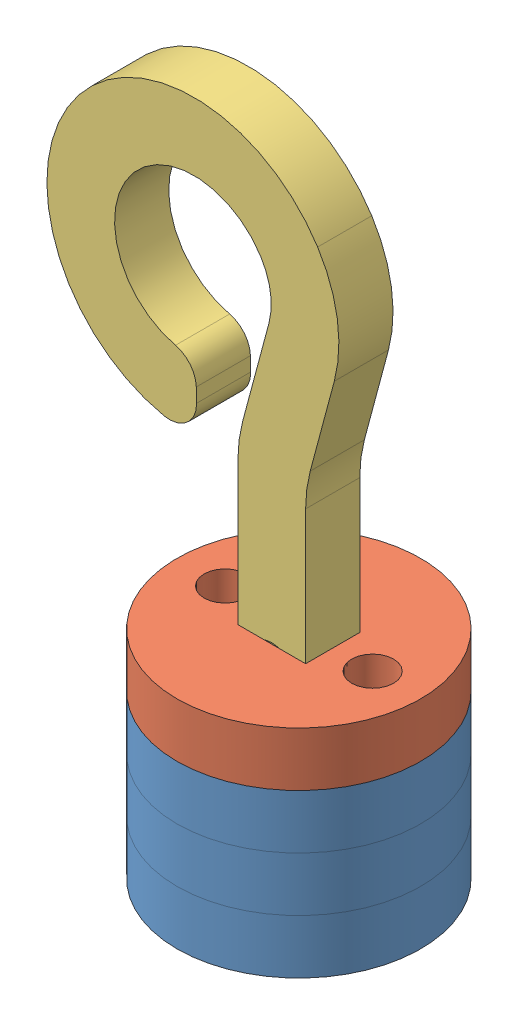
SolidWorks assembly LC_ASM.SLDASM, configuration Default (file format 10000). Lengths in mm.
Overall size (25.61 48.12 18).
5 component instances, 3 part files, 12 mates.
Components (placement in the parent):
- LC_MOTOR-1: LC_MOTOR.SLDPRT [Default] at (-77.2541 9.1015 35.9413) size (18 4 18)
- LC_CHOOK-1: LC_CHOOK.SLDPRT [LC_CHOOK] at (-77.2541 21.1015 35.9413) size (18 4 18)
- LC_MOTOR-2: LC_MOTOR.SLDPRT [Default] at (-77.2541 13.1015 35.9413) size (18 4 18)
- LC_MOTOR-3: LC_MOTOR.SLDPRT [Default] at (-77.2541 17.1015 35.9413) size (18 4 18)
- LC_HOOK-1: LC_HOOK.SLDPRT [Default] at (-74.7541 17.1015 37.9413) x (1 0 0) z (0 -1 0) size (21.58 4 36.12)
Mates (geometry in assembly coordinates):
- Concentric1: concentric aligned: cylinder of LC_MOTOR-1 through (-82.7041 -0.8985 35.9413) axis (0 1 0) radius 1.55; cylinder of LC_MOTOR-2 through (-82.7041 3.1015 35.9413) axis (0 1 0) radius 1.55
- Concentric2: concentric aligned: cylinder of LC_MOTOR-2 through (-82.7041 3.1015 35.9413) axis (0 1 0) radius 1.55; cylinder of LC_MOTOR-3 through (-82.7041 7.1015 35.9413) axis (0 1 0) radius 1.55
- Coincident1: coincident aligned: cylinder of LC_CHOOK-1 through (-82.7041 11.1015 35.9413) axis (0 1 0) radius 1.55; circle of LC_MOTOR-3
- Coincident2: coincident anti-aligned: plane of LC_CHOOK-1 through (-77.2541 17.1015 35.9413) normal (0 -1 0); plane of LC_MOTOR-3 through (-77.2541 17.1015 35.9413) normal (0 1 0)
- Coincident3: coincident anti-aligned: plane of LC_MOTOR-2 through (-77.2541 13.1015 35.9413) normal (0 1 0); plane of LC_MOTOR-3 through (-77.2541 13.1015 35.9413) normal (0 -1 0)
- Coincident4: coincident anti-aligned: plane of LC_MOTOR-1 through (-77.2541 9.1015 35.9413) normal (0 1 0); plane of LC_MOTOR-2 through (-77.2541 9.1015 35.9413) normal (0 -1 0)
- Concentric3: concentric aligned: cylinder of LC_MOTOR-1 through (-71.8041 -0.8985 35.9413) axis (0 1 0) radius 1.55; cylinder of LC_MOTOR-2 through (-71.8041 3.1015 35.9413) axis (0 1 0) radius 1.55
- Concentric4: concentric aligned: cylinder of LC_MOTOR-1 through (-71.8041 -0.8985 35.9413) axis (0 1 0) radius 1.55; cylinder of LC_MOTOR-3 through (-71.8041 7.1015 35.9413) axis (0 1 0) radius 1.55
- Coincident6: coincident aligned: cylinder of LC_MOTOR-1 through (-71.8041 -0.8985 35.9413) axis (0 1 0) radius 1.55; circle of LC_CHOOK-1
- Coincident8: coincident anti-aligned: plane of LC_CHOOK-1 through (-79.7541 11.1015 37.9413) normal (0 0 -1); plane of LC_HOOK-1 through (-64.7541 31.0104 37.9413) normal (0 0 1)
- Coincident10: coincident anti-aligned: plane of LC_CHOOK-1 through (-74.7541 11.1015 37.9413) normal (-1 0 0); plane of LC_HOOK-1 through (-74.7541 17.1015 33.9413) normal (1 0 0)
- Coincident11: coincident anti-aligned: plane of LC_MOTOR-3 through (-77.2541 17.1015 35.9413) normal (0 1 0); plane of LC_HOOK-1 through (-74.7541 17.1015 33.9413) normal (0 -1 0)
